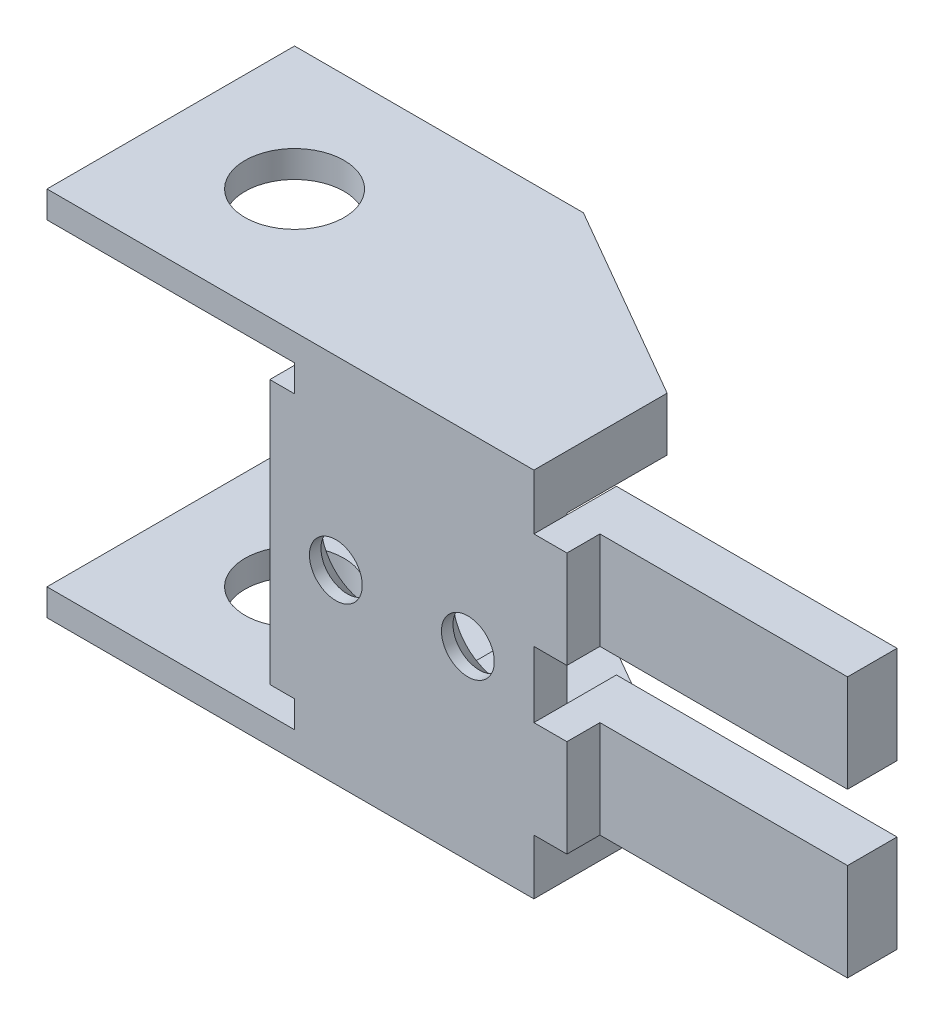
ISO-10303-21;
HEADER;
FILE_DESCRIPTION(('STEP AP214'),'2;1');
FILE_NAME('part.step','',(''),(''),'','','');
FILE_SCHEMA(('AUTOMOTIVE_DESIGN { 1 0 10303 214 1 1 1 1 }'));
ENDSEC;
DATA;
#1=APPLICATION_CONTEXT('core data for automotive mechanical design processes');
#2=APPLICATION_PROTOCOL_DEFINITION('international standard','automotive_design',2000,#1);
#3=PRODUCT_CONTEXT('',#1,'mechanical');
#4=PRODUCT('Part','Part','',(#3));
#5=PRODUCT_RELATED_PRODUCT_CATEGORY('part','',(#4));
#6=PRODUCT_DEFINITION_FORMATION('','',#4);
#7=PRODUCT_DEFINITION_CONTEXT('part definition',#1,'design');
#8=PRODUCT_DEFINITION('design','',#6,#7);
#9=PRODUCT_DEFINITION_SHAPE('','',#8);
#10=(LENGTH_UNIT() NAMED_UNIT(*) SI_UNIT(.MILLI.,.METRE.));
#11=(NAMED_UNIT(*) PLANE_ANGLE_UNIT() SI_UNIT($,.RADIAN.));
#12=(NAMED_UNIT(*) SI_UNIT($,.STERADIAN.) SOLID_ANGLE_UNIT());
#13=UNCERTAINTY_MEASURE_WITH_UNIT(LENGTH_MEASURE(1.E-05),#10,'distance_accuracy_value','');
#14=(GEOMETRIC_REPRESENTATION_CONTEXT(3) GLOBAL_UNCERTAINTY_ASSIGNED_CONTEXT((#13)) GLOBAL_UNIT_ASSIGNED_CONTEXT((#10,
#11,#12)) REPRESENTATION_CONTEXT('',''));
#15=CARTESIAN_POINT('',(0.,0.,0.));
#16=DIRECTION('',(0.,0.,1.));
#17=DIRECTION('',(1.,0.,0.));
#18=AXIS2_PLACEMENT_3D('',#15,#16,#17);
#19=CARTESIAN_POINT('',(-90.,8.00000000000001,41.5000000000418));
#20=DIRECTION('',(0.,0.,-1.));
#21=DIRECTION('',(-1.,0.,0.));
#22=AXIS2_PLACEMENT_3D('',#19,#20,#21);
#23=CONICAL_SURFACE('',#22,2.89999999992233,0.785398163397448);
#24=CARTESIAN_POINT('',(-90.,8.00000000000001,42.8));
#25=DIRECTION('',(0.,0.,-1.));
#26=DIRECTION('',(-1.,0.,0.));
#27=AXIS2_PLACEMENT_3D('',#24,#25,#26);
#28=CIRCLE('',#27,1.6);
#29=CARTESIAN_POINT('',(-91.6,8.00000000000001,42.8));
#30=VERTEX_POINT('',#29);
#31=EDGE_CURVE('E279',#30,#30,#28,.F.);
#32=ORIENTED_EDGE('',*,*,#31,.T.);
#33=EDGE_LOOP('',(#32));
#34=FACE_BOUND('',#33,.T.);
#35=CARTESIAN_POINT('',(-90.,8.00000000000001,41.499999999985));
#36=DIRECTION('',(0.,0.,-1.));
#37=DIRECTION('',(-1.,0.,0.));
#38=AXIS2_PLACEMENT_3D('',#35,#36,#37);
#39=CIRCLE('',#38,2.89999999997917);
#40=CARTESIAN_POINT('',(-92.8999999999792,8.00000000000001,41.499999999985));
#41=VERTEX_POINT('',#40);
#42=EDGE_CURVE('E19',#41,#41,#39,.F.);
#43=ORIENTED_EDGE('',*,*,#42,.F.);
#44=EDGE_LOOP('',(#43));
#45=FACE_BOUND('',#44,.T.);
#46=ADVANCED_FACE('F16',(#34,#45),#23,.F.);
#47=CARTESIAN_POINT('',(-82.,8.00000000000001,41.5000000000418));
#48=DIRECTION('',(0.,0.,-1.));
#49=DIRECTION('',(-1.,0.,0.));
#50=AXIS2_PLACEMENT_3D('',#47,#48,#49);
#51=CONICAL_SURFACE('',#50,2.89999999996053,0.785398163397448);
#52=CARTESIAN_POINT('',(-82.,8.00000000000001,42.8));
#53=DIRECTION('',(0.,0.,-1.));
#54=DIRECTION('',(-1.,0.,0.));
#55=AXIS2_PLACEMENT_3D('',#52,#53,#54);
#56=CIRCLE('',#55,1.6);
#57=CARTESIAN_POINT('',(-83.6,8.00000000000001,42.8));
#58=VERTEX_POINT('',#57);
#59=EDGE_CURVE('E275',#58,#58,#56,.F.);
#60=ORIENTED_EDGE('',*,*,#59,.T.);
#61=EDGE_LOOP('',(#60));
#62=FACE_BOUND('',#61,.T.);
#63=CARTESIAN_POINT('',(-82.,8.00000000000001,41.499999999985));
#64=DIRECTION('',(0.,0.,-1.));
#65=DIRECTION('',(-1.,0.,0.));
#66=AXIS2_PLACEMENT_3D('',#63,#64,#65);
#67=CIRCLE('',#66,2.90000000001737);
#68=CARTESIAN_POINT('',(-84.9000000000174,8.00000000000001,41.499999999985));
#69=VERTEX_POINT('',#68);
#70=EDGE_CURVE('E282',#69,#69,#67,.F.);
#71=ORIENTED_EDGE('',*,*,#70,.F.);
#72=EDGE_LOOP('',(#71));
#73=FACE_BOUND('',#72,.T.);
#74=ADVANCED_FACE('F901',(#62,#73),#51,.F.);
#75=CARTESIAN_POINT('',(-92.5,-0.8125,39.75));
#76=DIRECTION('',(-1.,0.,0.));
#77=DIRECTION('',(0.,0.,1.));
#78=AXIS2_PLACEMENT_3D('',#75,#76,#77);
#79=PLANE('',#78);
#80=DIRECTION('',(0.,1.,0.));
#81=VECTOR('',#80,1.);
#82=CARTESIAN_POINT('',(-92.5,-0.8125,43.5));
#83=LINE('',#82,#81);
#84=CARTESIAN_POINT('',(-92.5,-1.625,43.5));
#85=VERTEX_POINT('',#84);
#86=CARTESIAN_POINT('',(-92.5,0.,43.5));
#87=VERTEX_POINT('',#86);
#88=EDGE_CURVE('E272',#85,#87,#83,.T.);
#89=ORIENTED_EDGE('',*,*,#88,.T.);
#90=DIRECTION('',(0.,0.,1.));
#91=VECTOR('',#90,1.);
#92=CARTESIAN_POINT('',(-92.5,0.,39.75));
#93=LINE('',#92,#91);
#94=CARTESIAN_POINT('',(-92.5,0.,41.5));
#95=VERTEX_POINT('',#94);
#96=EDGE_CURVE('E345',#87,#95,#93,.F.);
#97=ORIENTED_EDGE('',*,*,#96,.T.);
#98=DIRECTION('',(0.,1.,0.));
#99=VECTOR('',#98,1.);
#100=CARTESIAN_POINT('',(-92.5,17.625,41.5));
#101=LINE('',#100,#99);
#102=CARTESIAN_POINT('',(-92.5,-1.625,41.5));
#103=VERTEX_POINT('',#102);
#104=EDGE_CURVE('E312',#103,#95,#101,.T.);
#105=ORIENTED_EDGE('',*,*,#104,.F.);
#106=DIRECTION('',(0.,0.,1.));
#107=VECTOR('',#106,1.);
#108=CARTESIAN_POINT('',(-92.5,-1.625,36.));
#109=LINE('',#108,#107);
#110=EDGE_CURVE('E278',#85,#103,#109,.F.);
#111=ORIENTED_EDGE('',*,*,#110,.F.);
#112=EDGE_LOOP('',(#89,#97,#105,#111));
#113=FACE_BOUND('',#112,.T.);
#114=ADVANCED_FACE('F442',(#113),#79,.T.);
#115=CARTESIAN_POINT('',(-89.,8.,36.));
#116=DIRECTION('',(-1.,0.,0.));
#117=DIRECTION('',(0.,0.,1.));
#118=AXIS2_PLACEMENT_3D('',#115,#116,#117);
#119=PLANE('',#118);
#120=DIRECTION('',(0.,1.,0.));
#121=VECTOR('',#120,1.);
#122=CARTESIAN_POINT('',(-89.,19.25,29.0773502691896));
#123=LINE('',#122,#121);
#124=CARTESIAN_POINT('',(-89.,-1.625,29.0773502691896));
#125=VERTEX_POINT('',#124);
#126=CARTESIAN_POINT('',(-89.,0.,29.0773502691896));
#127=VERTEX_POINT('',#126);
#128=EDGE_CURVE('E238',#125,#127,#123,.T.);
#129=ORIENTED_EDGE('',*,*,#128,.F.);
#130=DIRECTION('',(0.,0.,1.));
#131=VECTOR('',#130,1.);
#132=CARTESIAN_POINT('',(-89.,-1.625,36.));
#133=LINE('',#132,#131);
#134=CARTESIAN_POINT('',(-89.,-1.625,41.5));
#135=VERTEX_POINT('',#134);
#136=EDGE_CURVE('E432',#135,#125,#133,.F.);
#137=ORIENTED_EDGE('',*,*,#136,.F.);
#138=DIRECTION('',(0.,1.,0.));
#139=VECTOR('',#138,1.);
#140=CARTESIAN_POINT('',(-89.,17.625,41.5));
#141=LINE('',#140,#139);
#142=CARTESIAN_POINT('',(-89.,0.,41.5));
#143=VERTEX_POINT('',#142);
#144=EDGE_CURVE('E255',#143,#135,#141,.F.);
#145=ORIENTED_EDGE('',*,*,#144,.F.);
#146=DIRECTION('',(0.,0.,1.));
#147=VECTOR('',#146,1.);
#148=CARTESIAN_POINT('',(-89.,0.,36.));
#149=LINE('',#148,#147);
#150=EDGE_CURVE('E253',#127,#143,#149,.T.);
#151=ORIENTED_EDGE('',*,*,#150,.F.);
#152=EDGE_LOOP('',(#129,#137,#145,#151));
#153=FACE_BOUND('',#152,.T.);
#154=ADVANCED_FACE('F254',(#153),#119,.T.);
#155=CARTESIAN_POINT('',(-100.,8.,36.));
#156=DIRECTION('',(0.,-1.,0.));
#157=DIRECTION('',(0.,0.,-1.));
#158=AXIS2_PLACEMENT_3D('',#155,#156,#157);
#159=CYLINDRICAL_SURFACE('',#158,3.);
#160=CARTESIAN_POINT('',(-100.,-1.625,36.));
#161=DIRECTION('',(0.,-1.,0.));
#162=DIRECTION('',(0.,0.,-1.));
#163=AXIS2_PLACEMENT_3D('',#160,#161,#162);
#164=CIRCLE('',#163,3.);
#165=CARTESIAN_POINT('',(-100.,-1.625,33.));
#166=VERTEX_POINT('',#165);
#167=EDGE_CURVE('E305',#166,#166,#164,.T.);
#168=ORIENTED_EDGE('',*,*,#167,.F.);
#169=EDGE_LOOP('',(#168));
#170=FACE_BOUND('',#169,.T.);
#171=CARTESIAN_POINT('',(-100.,-3.25,36.));
#172=DIRECTION('',(0.,-1.,0.));
#173=DIRECTION('',(0.,0.,-1.));
#174=AXIS2_PLACEMENT_3D('',#171,#172,#173);
#175=CIRCLE('',#174,3.);
#176=CARTESIAN_POINT('',(-100.,-3.25,33.));
#177=VERTEX_POINT('',#176);
#178=EDGE_CURVE('E301',#177,#177,#175,.T.);
#179=ORIENTED_EDGE('',*,*,#178,.T.);
#180=EDGE_LOOP('',(#179));
#181=FACE_BOUND('',#180,.T.);
#182=ADVANCED_FACE('F932',(#170,#181),#159,.F.);
#183=CARTESIAN_POINT('',(-107.5,8.,36.));
#184=DIRECTION('',(1.,0.,0.));
#185=DIRECTION('',(0.,0.,-1.));
#186=AXIS2_PLACEMENT_3D('',#183,#184,#185);
#187=PLANE('',#186);
#188=DIRECTION('',(0.,1.,0.));
#189=VECTOR('',#188,1.);
#190=CARTESIAN_POINT('',(-107.5,19.25,28.5));
#191=LINE('',#190,#189);
#192=CARTESIAN_POINT('',(-107.5,-3.25,28.5));
#193=VERTEX_POINT('',#192);
#194=CARTESIAN_POINT('',(-107.5,-1.625,28.5));
#195=VERTEX_POINT('',#194);
#196=EDGE_CURVE('E268',#193,#195,#191,.T.);
#197=ORIENTED_EDGE('',*,*,#196,.F.);
#198=DIRECTION('',(0.,0.,1.));
#199=VECTOR('',#198,1.);
#200=CARTESIAN_POINT('',(-107.5,-3.25,36.8005982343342));
#201=LINE('',#200,#199);
#202=CARTESIAN_POINT('',(-107.5,-3.25,43.5));
#203=VERTEX_POINT('',#202);
#204=EDGE_CURVE('E304',#193,#203,#201,.T.);
#205=ORIENTED_EDGE('',*,*,#204,.T.);
#206=DIRECTION('',(0.,1.,0.));
#207=VECTOR('',#206,1.);
#208=CARTESIAN_POINT('',(-107.5,8.,43.5));
#209=LINE('',#208,#207);
#210=CARTESIAN_POINT('',(-107.5,-1.625,43.5));
#211=VERTEX_POINT('',#210);
#212=EDGE_CURVE('E270',#211,#203,#209,.F.);
#213=ORIENTED_EDGE('',*,*,#212,.F.);
#214=DIRECTION('',(0.,0.,1.));
#215=VECTOR('',#214,1.);
#216=CARTESIAN_POINT('',(-107.5,-1.625,36.));
#217=LINE('',#216,#215);
#218=EDGE_CURVE('E307',#195,#211,#217,.T.);
#219=ORIENTED_EDGE('',*,*,#218,.F.);
#220=EDGE_LOOP('',(#197,#205,#213,#219));
#221=FACE_BOUND('',#220,.T.);
#222=ADVANCED_FACE('F454',(#221),#187,.F.);
#223=CARTESIAN_POINT('',(-90.,19.25,28.5));
#224=DIRECTION('',(0.,0.,-1.));
#225=DIRECTION('',(-1.,0.,0.));
#226=AXIS2_PLACEMENT_3D('',#223,#224,#225);
#227=PLANE('',#226);
#228=DIRECTION('',(1.,0.,0.));
#229=VECTOR('',#228,1.);
#230=CARTESIAN_POINT('',(-92.3880407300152,-3.25,28.5));
#231=LINE('',#230,#229);
#232=CARTESIAN_POINT('',(-90.,-3.25,28.5));
#233=VERTEX_POINT('',#232);
#234=EDGE_CURVE('E418',#233,#193,#231,.F.);
#235=ORIENTED_EDGE('',*,*,#234,.T.);
#236=ORIENTED_EDGE('',*,*,#196,.T.);
#237=DIRECTION('',(1.,0.,0.));
#238=VECTOR('',#237,1.);
#239=CARTESIAN_POINT('',(-98.25,-1.625,28.5));
#240=LINE('',#239,#238);
#241=CARTESIAN_POINT('',(-90.,-1.625,28.5));
#242=VERTEX_POINT('',#241);
#243=EDGE_CURVE('E428',#242,#195,#240,.F.);
#244=ORIENTED_EDGE('',*,*,#243,.F.);
#245=DIRECTION('',(0.,1.,0.));
#246=VECTOR('',#245,1.);
#247=CARTESIAN_POINT('',(-90.,19.25,28.5));
#248=LINE('',#247,#246);
#249=EDGE_CURVE('E250',#233,#242,#248,.T.);
#250=ORIENTED_EDGE('',*,*,#249,.F.);
#251=EDGE_LOOP('',(#235,#236,#244,#250));
#252=FACE_BOUND('',#251,.T.);
#253=ADVANCED_FACE('F450',(#252),#227,.T.);
#254=CARTESIAN_POINT('',(-78.,19.25,35.4282032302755));
#255=DIRECTION('',(0.5,0.,-0.866025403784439));
#256=DIRECTION('',(-0.866025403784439,0.,-0.5));
#257=AXIS2_PLACEMENT_3D('',#254,#255,#256);
#258=PLANE('',#257);
#259=DIRECTION('',(-0.866025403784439,0.,-0.5));
#260=VECTOR('',#259,1.);
#261=CARTESIAN_POINT('',(-89.,-1.625,29.0773502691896));
#262=LINE('',#261,#260);
#263=EDGE_CURVE('E246',#125,#242,#262,.T.);
#264=ORIENTED_EDGE('',*,*,#263,.F.);
#265=ORIENTED_EDGE('',*,*,#128,.T.);
#266=DIRECTION('',(-0.866025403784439,0.,-0.5));
#267=VECTOR('',#266,1.);
#268=CARTESIAN_POINT('',(-78.,0.,35.4282032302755));
#269=LINE('',#268,#267);
#270=CARTESIAN_POINT('',(-78.,0.,35.4282032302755));
#271=VERTEX_POINT('',#270);
#272=EDGE_CURVE('E243',#271,#127,#269,.T.);
#273=ORIENTED_EDGE('',*,*,#272,.F.);
#274=DIRECTION('',(0.,1.,0.));
#275=VECTOR('',#274,1.);
#276=CARTESIAN_POINT('',(-78.,-1.89999999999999,35.4282032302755));
#277=LINE('',#276,#275);
#278=CARTESIAN_POINT('',(-78.,-3.25,35.4282032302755));
#279=VERTEX_POINT('',#278);
#280=EDGE_CURVE('E410',#279,#271,#277,.T.);
#281=ORIENTED_EDGE('',*,*,#280,.F.);
#282=DIRECTION('',(-0.866025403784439,0.,-0.5));
#283=VECTOR('',#282,1.);
#284=CARTESIAN_POINT('',(-78.,-3.25,35.4282032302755));
#285=LINE('',#284,#283);
#286=EDGE_CURVE('E421',#279,#233,#285,.T.);
#287=ORIENTED_EDGE('',*,*,#286,.T.);
#288=ORIENTED_EDGE('',*,*,#249,.T.);
#289=EDGE_LOOP('',(#264,#265,#273,#281,#287,#288));
#290=FACE_BOUND('',#289,.T.);
#291=ADVANCED_FACE('F240',(#290),#258,.T.);
#292=CARTESIAN_POINT('',(-90.5,0.,36.));
#293=DIRECTION('',(0.,1.,0.));
#294=DIRECTION('',(0.,0.,1.));
#295=AXIS2_PLACEMENT_3D('',#292,#293,#294);
#296=PLANE('',#295);
#297=ORIENTED_EDGE('',*,*,#272,.T.);
#298=ORIENTED_EDGE('',*,*,#150,.T.);
#299=DIRECTION('',(-1.,0.,0.));
#300=VECTOR('',#299,1.);
#301=CARTESIAN_POINT('',(-78.,0.,41.5));
#302=LINE('',#301,#300);
#303=CARTESIAN_POINT('',(-78.,0.,41.5));
#304=VERTEX_POINT('',#303);
#305=EDGE_CURVE('E320',#304,#143,#302,.T.);
#306=ORIENTED_EDGE('',*,*,#305,.F.);
#307=DIRECTION('',(0.,0.,-1.));
#308=VECTOR('',#307,1.);
#309=CARTESIAN_POINT('',(-78.,0.,39.75));
#310=LINE('',#309,#308);
#311=EDGE_CURVE('E262',#271,#304,#310,.F.);
#312=ORIENTED_EDGE('',*,*,#311,.F.);
#313=EDGE_LOOP('',(#297,#298,#306,#312));
#314=FACE_BOUND('',#313,.T.);
#315=ADVANCED_FACE('F260',(#314),#296,.T.);
#316=CARTESIAN_POINT('',(-76.,17.625,41.5));
#317=DIRECTION('',(0.,0.,1.));
#318=DIRECTION('',(1.,0.,0.));
#319=AXIS2_PLACEMENT_3D('',#316,#317,#318);
#320=PLANE('',#319);
#321=DIRECTION('',(1.,0.,0.));
#322=VECTOR('',#321,1.);
#323=CARTESIAN_POINT('',(-69.5,6.00000000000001,41.5));
#324=LINE('',#323,#322);
#325=CARTESIAN_POINT('',(-76.,6.00000000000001,41.5));
#326=VERTEX_POINT('',#325);
#327=CARTESIAN_POINT('',(-61.,6.00000000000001,41.5));
#328=VERTEX_POINT('',#327);
#329=EDGE_CURVE('E555',#326,#328,#324,.T.);
#330=ORIENTED_EDGE('',*,*,#329,.F.);
#331=DIRECTION('',(0.,1.,0.));
#332=VECTOR('',#331,1.);
#333=CARTESIAN_POINT('',(-76.,17.625,41.5));
#334=LINE('',#333,#332);
#335=CARTESIAN_POINT('',(-76.,0.100000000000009,41.5));
#336=VERTEX_POINT('',#335);
#337=EDGE_CURVE('E391',#336,#326,#334,.T.);
#338=ORIENTED_EDGE('',*,*,#337,.F.);
#339=DIRECTION('',(1.,0.,0.));
#340=VECTOR('',#339,1.);
#341=CARTESIAN_POINT('',(-69.5,0.100000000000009,41.5));
#342=LINE('',#341,#340);
#343=CARTESIAN_POINT('',(-61.,0.100000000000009,41.5));
#344=VERTEX_POINT('',#343);
#345=EDGE_CURVE('E389',#344,#336,#342,.F.);
#346=ORIENTED_EDGE('',*,*,#345,.F.);
#347=DIRECTION('',(0.,1.,0.));
#348=VECTOR('',#347,1.);
#349=CARTESIAN_POINT('',(-61.,17.625,41.5));
#350=LINE('',#349,#348);
#351=EDGE_CURVE('E258',#328,#344,#350,.F.);
#352=ORIENTED_EDGE('',*,*,#351,.F.);
#353=EDGE_LOOP('',(#330,#338,#346,#352));
#354=FACE_BOUND('',#353,.T.);
#355=ADVANCED_FACE('F390',(#354),#320,.T.);
#356=CARTESIAN_POINT('',(-61.,17.625,41.5));
#357=DIRECTION('',(1.,0.,0.));
#358=DIRECTION('',(0.,0.,-1.));
#359=AXIS2_PLACEMENT_3D('',#356,#357,#358);
#360=PLANE('',#359);
#361=DIRECTION('',(0.,0.,1.));
#362=VECTOR('',#361,1.);
#363=CARTESIAN_POINT('',(-61.,6.00000000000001,39.75));
#364=LINE('',#363,#362);
#365=CARTESIAN_POINT('',(-61.,6.00000000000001,38.5));
#366=VERTEX_POINT('',#365);
#367=EDGE_CURVE('E384',#328,#366,#364,.F.);
#368=ORIENTED_EDGE('',*,*,#367,.F.);
#369=ORIENTED_EDGE('',*,*,#351,.T.);
#370=DIRECTION('',(0.,0.,-1.));
#371=VECTOR('',#370,1.);
#372=CARTESIAN_POINT('',(-61.,0.100000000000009,39.75));
#373=LINE('',#372,#371);
#374=CARTESIAN_POINT('',(-61.,0.100000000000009,38.5));
#375=VERTEX_POINT('',#374);
#376=EDGE_CURVE('E381',#375,#344,#373,.F.);
#377=ORIENTED_EDGE('',*,*,#376,.F.);
#378=DIRECTION('',(0.,1.,0.));
#379=VECTOR('',#378,1.);
#380=CARTESIAN_POINT('',(-61.,17.625,38.5));
#381=LINE('',#380,#379);
#382=EDGE_CURVE('E374',#366,#375,#381,.F.);
#383=ORIENTED_EDGE('',*,*,#382,.F.);
#384=EDGE_LOOP('',(#368,#369,#377,#383));
#385=FACE_BOUND('',#384,.T.);
#386=ADVANCED_FACE('F379',(#385),#360,.T.);
#387=CARTESIAN_POINT('',(-61.,17.625,38.5));
#388=DIRECTION('',(0.,0.,-1.));
#389=DIRECTION('',(-1.,0.,0.));
#390=AXIS2_PLACEMENT_3D('',#387,#388,#389);
#391=PLANE('',#390);
#392=DIRECTION('',(1.,0.,0.));
#393=VECTOR('',#392,1.);
#394=CARTESIAN_POINT('',(-69.5,6.00000000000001,38.5));
#395=LINE('',#394,#393);
#396=CARTESIAN_POINT('',(-78.,6.00000000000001,38.5));
#397=VERTEX_POINT('',#396);
#398=EDGE_CURVE('E551',#366,#397,#395,.F.);
#399=ORIENTED_EDGE('',*,*,#398,.F.);
#400=ORIENTED_EDGE('',*,*,#382,.T.);
#401=DIRECTION('',(1.,0.,0.));
#402=VECTOR('',#401,1.);
#403=CARTESIAN_POINT('',(-69.5,0.100000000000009,38.5));
#404=LINE('',#403,#402);
#405=CARTESIAN_POINT('',(-78.,0.100000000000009,38.5));
#406=VERTEX_POINT('',#405);
#407=EDGE_CURVE('E399',#406,#375,#404,.T.);
#408=ORIENTED_EDGE('',*,*,#407,.F.);
#409=DIRECTION('',(0.,1.,0.));
#410=VECTOR('',#409,1.);
#411=CARTESIAN_POINT('',(-78.,17.625,38.5));
#412=LINE('',#411,#410);
#413=EDGE_CURVE('E372',#397,#406,#412,.F.);
#414=ORIENTED_EDGE('',*,*,#413,.F.);
#415=EDGE_LOOP('',(#399,#400,#408,#414));
#416=FACE_BOUND('',#415,.T.);
#417=ADVANCED_FACE('F650',(#416),#391,.T.);
#418=CARTESIAN_POINT('',(-78.,17.625,38.5));
#419=DIRECTION('',(-1.,0.,0.));
#420=DIRECTION('',(0.,0.,1.));
#421=AXIS2_PLACEMENT_3D('',#418,#419,#420);
#422=PLANE('',#421);
#423=DIRECTION('',(0.,0.,1.));
#424=VECTOR('',#423,1.);
#425=CARTESIAN_POINT('',(-78.,6.00000000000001,39.75));
#426=LINE('',#425,#424);
#427=CARTESIAN_POINT('',(-78.,6.00000000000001,41.5));
#428=VERTEX_POINT('',#427);
#429=EDGE_CURVE('E548',#397,#428,#426,.T.);
#430=ORIENTED_EDGE('',*,*,#429,.F.);
#431=ORIENTED_EDGE('',*,*,#413,.T.);
#432=DIRECTION('',(0.,0.,-1.));
#433=VECTOR('',#432,1.);
#434=CARTESIAN_POINT('',(-78.,0.100000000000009,39.75));
#435=LINE('',#434,#433);
#436=CARTESIAN_POINT('',(-78.,0.100000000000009,41.5));
#437=VERTEX_POINT('',#436);
#438=EDGE_CURVE('E401',#437,#406,#435,.T.);
#439=ORIENTED_EDGE('',*,*,#438,.F.);
#440=DIRECTION('',(0.,1.,0.));
#441=VECTOR('',#440,1.);
#442=CARTESIAN_POINT('',(-78.,17.625,41.5));
#443=LINE('',#442,#441);
#444=EDGE_CURVE('E326',#428,#437,#443,.F.);
#445=ORIENTED_EDGE('',*,*,#444,.F.);
#446=EDGE_LOOP('',(#430,#431,#439,#445));
#447=FACE_BOUND('',#446,.T.);
#448=ADVANCED_FACE('F647',(#447),#422,.T.);
#449=CARTESIAN_POINT('',(-76.,17.625,41.5));
#450=DIRECTION('',(0.,0.,1.));
#451=DIRECTION('',(1.,0.,0.));
#452=AXIS2_PLACEMENT_3D('',#449,#450,#451);
#453=PLANE('',#452);
#454=DIRECTION('',(1.,0.,0.));
#455=VECTOR('',#454,1.);
#456=CARTESIAN_POINT('',(-69.5,15.9,41.5));
#457=LINE('',#456,#455);
#458=CARTESIAN_POINT('',(-76.,15.9,41.5));
#459=VERTEX_POINT('',#458);
#460=CARTESIAN_POINT('',(-61.,15.9,41.5));
#461=VERTEX_POINT('',#460);
#462=EDGE_CURVE('E519',#459,#461,#457,.T.);
#463=ORIENTED_EDGE('',*,*,#462,.F.);
#464=DIRECTION('',(0.,1.,0.));
#465=VECTOR('',#464,1.);
#466=CARTESIAN_POINT('',(-76.,17.625,41.5));
#467=LINE('',#466,#465);
#468=CARTESIAN_POINT('',(-76.,10.,41.5));
#469=VERTEX_POINT('',#468);
#470=EDGE_CURVE('E522',#469,#459,#467,.T.);
#471=ORIENTED_EDGE('',*,*,#470,.F.);
#472=DIRECTION('',(1.,0.,0.));
#473=VECTOR('',#472,1.);
#474=CARTESIAN_POINT('',(-69.5,10.,41.5));
#475=LINE('',#474,#473);
#476=CARTESIAN_POINT('',(-61.,10.,41.5));
#477=VERTEX_POINT('',#476);
#478=EDGE_CURVE('E528',#477,#469,#475,.F.);
#479=ORIENTED_EDGE('',*,*,#478,.F.);
#480=DIRECTION('',(0.,1.,0.));
#481=VECTOR('',#480,1.);
#482=CARTESIAN_POINT('',(-61.,17.625,41.5));
#483=LINE('',#482,#481);
#484=EDGE_CURVE('E370',#461,#477,#483,.F.);
#485=ORIENTED_EDGE('',*,*,#484,.F.);
#486=EDGE_LOOP('',(#463,#471,#479,#485));
#487=FACE_BOUND('',#486,.T.);
#488=ADVANCED_FACE('F657',(#487),#453,.T.);
#489=CARTESIAN_POINT('',(-61.,17.625,41.5));
#490=DIRECTION('',(1.,0.,0.));
#491=DIRECTION('',(0.,0.,-1.));
#492=AXIS2_PLACEMENT_3D('',#489,#490,#491);
#493=PLANE('',#492);
#494=DIRECTION('',(0.,0.,1.));
#495=VECTOR('',#494,1.);
#496=CARTESIAN_POINT('',(-61.,15.9,39.75));
#497=LINE('',#496,#495);
#498=CARTESIAN_POINT('',(-61.,15.9,38.5));
#499=VERTEX_POINT('',#498);
#500=EDGE_CURVE('E516',#461,#499,#497,.F.);
#501=ORIENTED_EDGE('',*,*,#500,.F.);
#502=ORIENTED_EDGE('',*,*,#484,.T.);
#503=DIRECTION('',(0.,0.,-1.));
#504=VECTOR('',#503,1.);
#505=CARTESIAN_POINT('',(-61.,10.,39.75));
#506=LINE('',#505,#504);
#507=CARTESIAN_POINT('',(-61.,10.,38.5));
#508=VERTEX_POINT('',#507);
#509=EDGE_CURVE('E530',#508,#477,#506,.F.);
#510=ORIENTED_EDGE('',*,*,#509,.F.);
#511=DIRECTION('',(0.,1.,0.));
#512=VECTOR('',#511,1.);
#513=CARTESIAN_POINT('',(-61.,17.625,38.5));
#514=LINE('',#513,#512);
#515=EDGE_CURVE('E368',#499,#508,#514,.F.);
#516=ORIENTED_EDGE('',*,*,#515,.F.);
#517=EDGE_LOOP('',(#501,#502,#510,#516));
#518=FACE_BOUND('',#517,.T.);
#519=ADVANCED_FACE('F661',(#518),#493,.T.);
#520=CARTESIAN_POINT('',(-61.,17.625,38.5));
#521=DIRECTION('',(0.,0.,-1.));
#522=DIRECTION('',(-1.,0.,0.));
#523=AXIS2_PLACEMENT_3D('',#520,#521,#522);
#524=PLANE('',#523);
#525=DIRECTION('',(1.,0.,0.));
#526=VECTOR('',#525,1.);
#527=CARTESIAN_POINT('',(-69.5,15.9,38.5));
#528=LINE('',#527,#526);
#529=CARTESIAN_POINT('',(-78.,15.9,38.5));
#530=VERTEX_POINT('',#529);
#531=EDGE_CURVE('E513',#499,#530,#528,.F.);
#532=ORIENTED_EDGE('',*,*,#531,.F.);
#533=ORIENTED_EDGE('',*,*,#515,.T.);
#534=DIRECTION('',(1.,0.,0.));
#535=VECTOR('',#534,1.);
#536=CARTESIAN_POINT('',(-69.5,10.,38.5));
#537=LINE('',#536,#535);
#538=CARTESIAN_POINT('',(-78.,10.,38.5));
#539=VERTEX_POINT('',#538);
#540=EDGE_CURVE('E533',#539,#508,#537,.T.);
#541=ORIENTED_EDGE('',*,*,#540,.F.);
#542=DIRECTION('',(0.,1.,0.));
#543=VECTOR('',#542,1.);
#544=CARTESIAN_POINT('',(-78.,17.625,38.5));
#545=LINE('',#544,#543);
#546=EDGE_CURVE('E366',#530,#539,#545,.F.);
#547=ORIENTED_EDGE('',*,*,#546,.F.);
#548=EDGE_LOOP('',(#532,#533,#541,#547));
#549=FACE_BOUND('',#548,.T.);
#550=ADVANCED_FACE('F663',(#549),#524,.T.);
#551=CARTESIAN_POINT('',(-78.,17.625,38.5));
#552=DIRECTION('',(-1.,0.,0.));
#553=DIRECTION('',(0.,0.,1.));
#554=AXIS2_PLACEMENT_3D('',#551,#552,#553);
#555=PLANE('',#554);
#556=DIRECTION('',(0.,0.,1.));
#557=VECTOR('',#556,1.);
#558=CARTESIAN_POINT('',(-78.,15.9,39.75));
#559=LINE('',#558,#557);
#560=CARTESIAN_POINT('',(-78.,15.9,41.5));
#561=VERTEX_POINT('',#560);
#562=EDGE_CURVE('E510',#530,#561,#559,.T.);
#563=ORIENTED_EDGE('',*,*,#562,.F.);
#564=ORIENTED_EDGE('',*,*,#546,.T.);
#565=DIRECTION('',(0.,0.,-1.));
#566=VECTOR('',#565,1.);
#567=CARTESIAN_POINT('',(-78.,10.,39.75));
#568=LINE('',#567,#566);
#569=CARTESIAN_POINT('',(-78.,10.,41.5));
#570=VERTEX_POINT('',#569);
#571=EDGE_CURVE('E536',#570,#539,#568,.T.);
#572=ORIENTED_EDGE('',*,*,#571,.F.);
#573=DIRECTION('',(0.,1.,0.));
#574=VECTOR('',#573,1.);
#575=CARTESIAN_POINT('',(-78.,17.625,41.5));
#576=LINE('',#575,#574);
#577=EDGE_CURVE('E328',#561,#570,#576,.F.);
#578=ORIENTED_EDGE('',*,*,#577,.F.);
#579=EDGE_LOOP('',(#563,#564,#572,#578));
#580=FACE_BOUND('',#579,.T.);
#581=ADVANCED_FACE('F632',(#580),#555,.T.);
#582=CARTESIAN_POINT('',(-90.5,16.,36.));
#583=DIRECTION('',(0.,1.,0.));
#584=DIRECTION('',(0.,0.,1.));
#585=AXIS2_PLACEMENT_3D('',#582,#583,#584);
#586=PLANE('',#585);
#587=DIRECTION('',(0.,0.,1.));
#588=VECTOR('',#587,1.);
#589=CARTESIAN_POINT('',(-89.,16.,36.));
#590=LINE('',#589,#588);
#591=CARTESIAN_POINT('',(-89.,16.,29.0773502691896));
#592=VERTEX_POINT('',#591);
#593=CARTESIAN_POINT('',(-89.,16.,41.5));
#594=VERTEX_POINT('',#593);
#595=EDGE_CURVE('E358',#592,#594,#590,.T.);
#596=ORIENTED_EDGE('',*,*,#595,.F.);
#597=DIRECTION('',(-0.866025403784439,0.,-0.5));
#598=VECTOR('',#597,1.);
#599=CARTESIAN_POINT('',(-78.,16.,35.4282032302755));
#600=LINE('',#599,#598);
#601=CARTESIAN_POINT('',(-78.,16.,35.4282032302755));
#602=VERTEX_POINT('',#601);
#603=EDGE_CURVE('E233',#602,#592,#600,.T.);
#604=ORIENTED_EDGE('',*,*,#603,.F.);
#605=DIRECTION('',(0.,0.,-1.));
#606=VECTOR('',#605,1.);
#607=CARTESIAN_POINT('',(-78.,16.,39.75));
#608=LINE('',#607,#606);
#609=CARTESIAN_POINT('',(-78.,16.,41.5));
#610=VERTEX_POINT('',#609);
#611=EDGE_CURVE('E498',#610,#602,#608,.T.);
#612=ORIENTED_EDGE('',*,*,#611,.F.);
#613=DIRECTION('',(-1.,0.,0.));
#614=VECTOR('',#613,1.);
#615=CARTESIAN_POINT('',(-78.,16.,41.5));
#616=LINE('',#615,#614);
#617=EDGE_CURVE('E330',#594,#610,#616,.F.);
#618=ORIENTED_EDGE('',*,*,#617,.F.);
#619=EDGE_LOOP('',(#596,#604,#612,#618));
#620=FACE_BOUND('',#619,.T.);
#621=ADVANCED_FACE('F620',(#620),#586,.F.);
#622=CARTESIAN_POINT('',(-78.,19.25,35.4282032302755));
#623=DIRECTION('',(0.5,0.,-0.866025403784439));
#624=DIRECTION('',(-0.866025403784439,0.,-0.5));
#625=AXIS2_PLACEMENT_3D('',#622,#623,#624);
#626=PLANE('',#625);
#627=DIRECTION('',(-0.866025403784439,0.,-0.5));
#628=VECTOR('',#627,1.);
#629=CARTESIAN_POINT('',(-78.,19.25,35.4282032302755));
#630=LINE('',#629,#628);
#631=CARTESIAN_POINT('',(-78.,19.25,35.4282032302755));
#632=VERTEX_POINT('',#631);
#633=CARTESIAN_POINT('',(-90.,19.25,28.5));
#634=VERTEX_POINT('',#633);
#635=EDGE_CURVE('E492',#632,#634,#630,.T.);
#636=ORIENTED_EDGE('',*,*,#635,.F.);
#637=DIRECTION('',(0.,1.,0.));
#638=VECTOR('',#637,1.);
#639=CARTESIAN_POINT('',(-78.,17.9,35.4282032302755));
#640=LINE('',#639,#638);
#641=EDGE_CURVE('E300',#602,#632,#640,.T.);
#642=ORIENTED_EDGE('',*,*,#641,.F.);
#643=ORIENTED_EDGE('',*,*,#603,.T.);
#644=DIRECTION('',(0.,1.,0.));
#645=VECTOR('',#644,1.);
#646=CARTESIAN_POINT('',(-89.,8.,29.0773502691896));
#647=LINE('',#646,#645);
#648=CARTESIAN_POINT('',(-89.,17.625,29.0773502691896));
#649=VERTEX_POINT('',#648);
#650=EDGE_CURVE('E360',#649,#592,#647,.F.);
#651=ORIENTED_EDGE('',*,*,#650,.F.);
#652=DIRECTION('',(-0.866025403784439,0.,-0.5));
#653=VECTOR('',#652,1.);
#654=CARTESIAN_POINT('',(-78.,17.625,35.4282032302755));
#655=LINE('',#654,#653);
#656=CARTESIAN_POINT('',(-90.,17.625,28.5));
#657=VERTEX_POINT('',#656);
#658=EDGE_CURVE('E363',#649,#657,#655,.T.);
#659=ORIENTED_EDGE('',*,*,#658,.T.);
#660=DIRECTION('',(0.,1.,0.));
#661=VECTOR('',#660,1.);
#662=CARTESIAN_POINT('',(-90.,19.25,28.5));
#663=LINE('',#662,#661);
#664=EDGE_CURVE('E355',#634,#657,#663,.F.);
#665=ORIENTED_EDGE('',*,*,#664,.F.);
#666=EDGE_LOOP('',(#636,#642,#643,#651,#659,#665));
#667=FACE_BOUND('',#666,.T.);
#668=ADVANCED_FACE('F743',(#667),#626,.T.);
#669=CARTESIAN_POINT('',(-89.,8.,36.));
#670=DIRECTION('',(-1.,0.,0.));
#671=DIRECTION('',(0.,0.,1.));
#672=AXIS2_PLACEMENT_3D('',#669,#670,#671);
#673=PLANE('',#672);
#674=ORIENTED_EDGE('',*,*,#650,.T.);
#675=ORIENTED_EDGE('',*,*,#595,.T.);
#676=DIRECTION('',(0.,1.,0.));
#677=VECTOR('',#676,1.);
#678=CARTESIAN_POINT('',(-89.,17.625,41.5));
#679=LINE('',#678,#677);
#680=CARTESIAN_POINT('',(-89.,17.625,41.5));
#681=VERTEX_POINT('',#680);
#682=EDGE_CURVE('E332',#681,#594,#679,.F.);
#683=ORIENTED_EDGE('',*,*,#682,.F.);
#684=DIRECTION('',(0.,0.,1.));
#685=VECTOR('',#684,1.);
#686=CARTESIAN_POINT('',(-89.,17.625,36.));
#687=LINE('',#686,#685);
#688=EDGE_CURVE('E480',#681,#649,#687,.F.);
#689=ORIENTED_EDGE('',*,*,#688,.T.);
#690=EDGE_LOOP('',(#674,#675,#683,#689));
#691=FACE_BOUND('',#690,.T.);
#692=ADVANCED_FACE('F616',(#691),#673,.T.);
#693=CARTESIAN_POINT('',(-90.,19.25,28.5));
#694=DIRECTION('',(0.,0.,-1.));
#695=DIRECTION('',(-1.,0.,0.));
#696=AXIS2_PLACEMENT_3D('',#693,#694,#695);
#697=PLANE('',#696);
#698=DIRECTION('',(1.,0.,0.));
#699=VECTOR('',#698,1.);
#700=CARTESIAN_POINT('',(-92.3880407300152,19.25,28.5));
#701=LINE('',#700,#699);
#702=CARTESIAN_POINT('',(-107.5,19.25,28.5));
#703=VERTEX_POINT('',#702);
#704=EDGE_CURVE('E489',#634,#703,#701,.F.);
#705=ORIENTED_EDGE('',*,*,#704,.F.);
#706=ORIENTED_EDGE('',*,*,#664,.T.);
#707=DIRECTION('',(1.,0.,0.));
#708=VECTOR('',#707,1.);
#709=CARTESIAN_POINT('',(-98.25,17.625,28.5));
#710=LINE('',#709,#708);
#711=CARTESIAN_POINT('',(-107.5,17.625,28.5));
#712=VERTEX_POINT('',#711);
#713=EDGE_CURVE('E478',#657,#712,#710,.F.);
#714=ORIENTED_EDGE('',*,*,#713,.T.);
#715=DIRECTION('',(0.,1.,0.));
#716=VECTOR('',#715,1.);
#717=CARTESIAN_POINT('',(-107.5,8.,28.5));
#718=LINE('',#717,#716);
#719=EDGE_CURVE('E353',#712,#703,#718,.T.);
#720=ORIENTED_EDGE('',*,*,#719,.T.);
#721=EDGE_LOOP('',(#705,#706,#714,#720));
#722=FACE_BOUND('',#721,.T.);
#723=ADVANCED_FACE('F736',(#722),#697,.T.);
#724=CARTESIAN_POINT('',(-107.5,8.,36.));
#725=DIRECTION('',(1.,0.,0.));
#726=DIRECTION('',(0.,0.,-1.));
#727=AXIS2_PLACEMENT_3D('',#724,#725,#726);
#728=PLANE('',#727);
#729=DIRECTION('',(0.,1.,0.));
#730=VECTOR('',#729,1.);
#731=CARTESIAN_POINT('',(-107.5,8.,43.5));
#732=LINE('',#731,#730);
#733=CARTESIAN_POINT('',(-107.5,19.25,43.5));
#734=VERTEX_POINT('',#733);
#735=CARTESIAN_POINT('',(-107.5,17.625,43.5));
#736=VERTEX_POINT('',#735);
#737=EDGE_CURVE('E351',#734,#736,#732,.F.);
#738=ORIENTED_EDGE('',*,*,#737,.F.);
#739=DIRECTION('',(0.,0.,1.));
#740=VECTOR('',#739,1.);
#741=CARTESIAN_POINT('',(-107.5,19.25,36.8005982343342));
#742=LINE('',#741,#740);
#743=EDGE_CURVE('E486',#703,#734,#742,.T.);
#744=ORIENTED_EDGE('',*,*,#743,.F.);
#745=ORIENTED_EDGE('',*,*,#719,.F.);
#746=DIRECTION('',(0.,0.,1.));
#747=VECTOR('',#746,1.);
#748=CARTESIAN_POINT('',(-107.5,17.625,36.));
#749=LINE('',#748,#747);
#750=EDGE_CURVE('E475',#712,#736,#749,.T.);
#751=ORIENTED_EDGE('',*,*,#750,.T.);
#752=EDGE_LOOP('',(#738,#744,#745,#751));
#753=FACE_BOUND('',#752,.T.);
#754=ADVANCED_FACE('F733',(#753),#728,.F.);
#755=CARTESIAN_POINT('',(-92.5,16.8125,39.75));
#756=DIRECTION('',(-1.,0.,0.));
#757=DIRECTION('',(0.,0.,1.));
#758=AXIS2_PLACEMENT_3D('',#755,#756,#757);
#759=PLANE('',#758);
#760=DIRECTION('',(0.,1.,0.));
#761=VECTOR('',#760,1.);
#762=CARTESIAN_POINT('',(-92.5,16.8125,43.5));
#763=LINE('',#762,#761);
#764=CARTESIAN_POINT('',(-92.5,16.,43.5));
#765=VERTEX_POINT('',#764);
#766=CARTESIAN_POINT('',(-92.5,17.625,43.5));
#767=VERTEX_POINT('',#766);
#768=EDGE_CURVE('E349',#765,#767,#763,.T.);
#769=ORIENTED_EDGE('',*,*,#768,.T.);
#770=DIRECTION('',(0.,0.,1.));
#771=VECTOR('',#770,1.);
#772=CARTESIAN_POINT('',(-92.5,17.625,36.));
#773=LINE('',#772,#771);
#774=CARTESIAN_POINT('',(-92.5,17.625,41.5));
#775=VERTEX_POINT('',#774);
#776=EDGE_CURVE('E295',#767,#775,#773,.F.);
#777=ORIENTED_EDGE('',*,*,#776,.T.);
#778=DIRECTION('',(0.,1.,0.));
#779=VECTOR('',#778,1.);
#780=CARTESIAN_POINT('',(-92.5,17.625,41.5));
#781=LINE('',#780,#779);
#782=CARTESIAN_POINT('',(-92.5,16.,41.5));
#783=VERTEX_POINT('',#782);
#784=EDGE_CURVE('E335',#783,#775,#781,.T.);
#785=ORIENTED_EDGE('',*,*,#784,.F.);
#786=DIRECTION('',(0.,0.,1.));
#787=VECTOR('',#786,1.);
#788=CARTESIAN_POINT('',(-92.5,16.,39.75));
#789=LINE('',#788,#787);
#790=EDGE_CURVE('E342',#765,#783,#789,.F.);
#791=ORIENTED_EDGE('',*,*,#790,.F.);
#792=EDGE_LOOP('',(#769,#777,#785,#791));
#793=FACE_BOUND('',#792,.T.);
#794=ADVANCED_FACE('F606',(#793),#759,.T.);
#795=CARTESIAN_POINT('',(-100.,8.,36.));
#796=DIRECTION('',(0.,-1.,0.));
#797=DIRECTION('',(0.,0.,-1.));
#798=AXIS2_PLACEMENT_3D('',#795,#796,#797);
#799=CYLINDRICAL_SURFACE('',#798,3.);
#800=CARTESIAN_POINT('',(-100.,17.625,36.));
#801=DIRECTION('',(0.,-1.,0.));
#802=DIRECTION('',(0.,0.,-1.));
#803=AXIS2_PLACEMENT_3D('',#800,#801,#802);
#804=CIRCLE('',#803,3.);
#805=CARTESIAN_POINT('',(-100.,17.625,33.));
#806=VERTEX_POINT('',#805);
#807=EDGE_CURVE('E291',#806,#806,#804,.T.);
#808=ORIENTED_EDGE('',*,*,#807,.T.);
#809=EDGE_LOOP('',(#808));
#810=FACE_BOUND('',#809,.T.);
#811=CARTESIAN_POINT('',(-100.,19.25,36.));
#812=DIRECTION('',(0.,-1.,0.));
#813=DIRECTION('',(0.,0.,-1.));
#814=AXIS2_PLACEMENT_3D('',#811,#812,#813);
#815=CIRCLE('',#814,3.);
#816=CARTESIAN_POINT('',(-100.,19.25,33.));
#817=VERTEX_POINT('',#816);
#818=EDGE_CURVE('E296',#817,#817,#815,.T.);
#819=ORIENTED_EDGE('',*,*,#818,.F.);
#820=EDGE_LOOP('',(#819));
#821=FACE_BOUND('',#820,.T.);
#822=ADVANCED_FACE('F727',(#810,#821),#799,.F.);
#823=CARTESIAN_POINT('',(-96.25,0.,39.75));
#824=DIRECTION('',(0.,1.,0.));
#825=DIRECTION('',(0.,0.,1.));
#826=AXIS2_PLACEMENT_3D('',#823,#824,#825);
#827=PLANE('',#826);
#828=ORIENTED_EDGE('',*,*,#96,.F.);
#829=DIRECTION('',(1.,0.,0.));
#830=VECTOR('',#829,1.);
#831=CARTESIAN_POINT('',(-96.25,0.,43.5));
#832=LINE('',#831,#830);
#833=CARTESIAN_POINT('',(-94.,0.,43.5));
#834=VERTEX_POINT('',#833);
#835=EDGE_CURVE('E347',#834,#87,#832,.T.);
#836=ORIENTED_EDGE('',*,*,#835,.F.);
#837=DIRECTION('',(0.,0.,1.));
#838=VECTOR('',#837,1.);
#839=CARTESIAN_POINT('',(-94.,0.,41.5));
#840=LINE('',#839,#838);
#841=CARTESIAN_POINT('',(-94.,0.,41.5));
#842=VERTEX_POINT('',#841);
#843=EDGE_CURVE('E294',#842,#834,#840,.T.);
#844=ORIENTED_EDGE('',*,*,#843,.F.);
#845=DIRECTION('',(-1.,0.,0.));
#846=VECTOR('',#845,1.);
#847=CARTESIAN_POINT('',(-78.,0.,41.5));
#848=LINE('',#847,#846);
#849=EDGE_CURVE('E340',#95,#842,#848,.T.);
#850=ORIENTED_EDGE('',*,*,#849,.F.);
#851=EDGE_LOOP('',(#828,#836,#844,#850));
#852=FACE_BOUND('',#851,.T.);
#853=ADVANCED_FACE('F614',(#852),#827,.F.);
#854=CARTESIAN_POINT('',(-96.25,16.,39.75));
#855=DIRECTION('',(0.,1.,0.));
#856=DIRECTION('',(0.,0.,1.));
#857=AXIS2_PLACEMENT_3D('',#854,#855,#856);
#858=PLANE('',#857);
#859=ORIENTED_EDGE('',*,*,#790,.T.);
#860=DIRECTION('',(-1.,0.,0.));
#861=VECTOR('',#860,1.);
#862=CARTESIAN_POINT('',(-78.,16.,41.5));
#863=LINE('',#862,#861);
#864=CARTESIAN_POINT('',(-94.,16.,41.5));
#865=VERTEX_POINT('',#864);
#866=EDGE_CURVE('E337',#865,#783,#863,.F.);
#867=ORIENTED_EDGE('',*,*,#866,.F.);
#868=DIRECTION('',(0.,0.,1.));
#869=VECTOR('',#868,1.);
#870=CARTESIAN_POINT('',(-94.,16.,41.5));
#871=LINE('',#870,#869);
#872=CARTESIAN_POINT('',(-94.,16.,43.5));
#873=VERTEX_POINT('',#872);
#874=EDGE_CURVE('E468',#873,#865,#871,.F.);
#875=ORIENTED_EDGE('',*,*,#874,.F.);
#876=DIRECTION('',(1.,0.,0.));
#877=VECTOR('',#876,1.);
#878=CARTESIAN_POINT('',(-96.25,16.,43.5));
#879=LINE('',#878,#877);
#880=EDGE_CURVE('E33',#873,#765,#879,.T.);
#881=ORIENTED_EDGE('',*,*,#880,.T.);
#882=EDGE_LOOP('',(#859,#867,#875,#881));
#883=FACE_BOUND('',#882,.T.);
#884=ADVANCED_FACE('F608',(#883),#858,.T.);
#885=CARTESIAN_POINT('',(-78.,17.625,41.5));
#886=DIRECTION('',(0.,0.,-1.));
#887=DIRECTION('',(-1.,0.,0.));
#888=AXIS2_PLACEMENT_3D('',#885,#886,#887);
#889=PLANE('',#888);
#890=ORIENTED_EDGE('',*,*,#70,.T.);
#891=EDGE_LOOP('',(#890));
#892=FACE_BOUND('',#891,.T.);
#893=ORIENTED_EDGE('',*,*,#42,.T.);
#894=EDGE_LOOP('',(#893));
#895=FACE_BOUND('',#894,.T.);
#896=DIRECTION('',(1.,0.,0.));
#897=VECTOR('',#896,1.);
#898=CARTESIAN_POINT('',(-98.25,-1.625,41.5));
#899=LINE('',#898,#897);
#900=EDGE_CURVE('E433',#103,#135,#899,.T.);
#901=ORIENTED_EDGE('',*,*,#900,.F.);
#902=ORIENTED_EDGE('',*,*,#104,.T.);
#903=ORIENTED_EDGE('',*,*,#849,.T.);
#904=DIRECTION('',(0.,1.,0.));
#905=VECTOR('',#904,1.);
#906=CARTESIAN_POINT('',(-94.,17.625,41.5));
#907=LINE('',#906,#905);
#908=EDGE_CURVE('E290',#865,#842,#907,.F.);
#909=ORIENTED_EDGE('',*,*,#908,.F.);
#910=ORIENTED_EDGE('',*,*,#866,.T.);
#911=ORIENTED_EDGE('',*,*,#784,.T.);
#912=DIRECTION('',(1.,0.,0.));
#913=VECTOR('',#912,1.);
#914=CARTESIAN_POINT('',(-98.25,17.625,41.5));
#915=LINE('',#914,#913);
#916=EDGE_CURVE('E483',#775,#681,#915,.T.);
#917=ORIENTED_EDGE('',*,*,#916,.T.);
#918=ORIENTED_EDGE('',*,*,#682,.T.);
#919=ORIENTED_EDGE('',*,*,#617,.T.);
#920=DIRECTION('',(0.,1.,0.));
#921=VECTOR('',#920,1.);
#922=CARTESIAN_POINT('',(-78.,17.9,41.5));
#923=LINE('',#922,#921);
#924=EDGE_CURVE('E501',#561,#610,#923,.T.);
#925=ORIENTED_EDGE('',*,*,#924,.F.);
#926=ORIENTED_EDGE('',*,*,#577,.T.);
#927=DIRECTION('',(0.,1.,0.));
#928=VECTOR('',#927,1.);
#929=CARTESIAN_POINT('',(-78.,8.00000000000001,41.5));
#930=LINE('',#929,#928);
#931=EDGE_CURVE('E545',#428,#570,#930,.T.);
#932=ORIENTED_EDGE('',*,*,#931,.F.);
#933=ORIENTED_EDGE('',*,*,#444,.T.);
#934=DIRECTION('',(0.,1.,0.));
#935=VECTOR('',#934,1.);
#936=CARTESIAN_POINT('',(-78.,-1.89999999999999,41.5));
#937=LINE('',#936,#935);
#938=EDGE_CURVE('E415',#304,#437,#937,.T.);
#939=ORIENTED_EDGE('',*,*,#938,.F.);
#940=ORIENTED_EDGE('',*,*,#305,.T.);
#941=ORIENTED_EDGE('',*,*,#144,.T.);
#942=EDGE_LOOP('',(#901,#902,#903,#909,#910,#911,#917,#918,#919,#925,#926,#932,#933,#939,#940,#941));
#943=FACE_BOUND('',#942,.T.);
#944=ADVANCED_FACE('F445',(#892,#895,#943),#889,.T.);
#945=CARTESIAN_POINT('',(-90.,8.00000000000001,43.15));
#946=DIRECTION('',(0.,0.,-1.));
#947=DIRECTION('',(-1.,0.,0.));
#948=AXIS2_PLACEMENT_3D('',#945,#946,#947);
#949=CYLINDRICAL_SURFACE('',#948,1.6);
#950=CARTESIAN_POINT('',(-90.,8.00000000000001,43.5));
#951=DIRECTION('',(0.,0.,-1.));
#952=DIRECTION('',(-1.,0.,0.));
#953=AXIS2_PLACEMENT_3D('',#950,#951,#952);
#954=CIRCLE('',#953,1.6);
#955=CARTESIAN_POINT('',(-91.6,8.00000000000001,43.5));
#956=VERTEX_POINT('',#955);
#957=EDGE_CURVE('E287',#956,#956,#954,.T.);
#958=ORIENTED_EDGE('',*,*,#957,.F.);
#959=EDGE_LOOP('',(#958));
#960=FACE_BOUND('',#959,.T.);
#961=ORIENTED_EDGE('',*,*,#31,.F.);
#962=EDGE_LOOP('',(#961));
#963=FACE_BOUND('',#962,.T.);
#964=ADVANCED_FACE('F716',(#960,#963),#949,.F.);
#965=CARTESIAN_POINT('',(-82.,8.00000000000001,43.15));
#966=DIRECTION('',(0.,0.,-1.));
#967=DIRECTION('',(-1.,0.,0.));
#968=AXIS2_PLACEMENT_3D('',#965,#966,#967);
#969=CYLINDRICAL_SURFACE('',#968,1.6);
#970=CARTESIAN_POINT('',(-82.,8.00000000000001,43.5));
#971=DIRECTION('',(0.,0.,-1.));
#972=DIRECTION('',(-1.,0.,0.));
#973=AXIS2_PLACEMENT_3D('',#970,#971,#972);
#974=CIRCLE('',#973,1.6);
#975=CARTESIAN_POINT('',(-83.6,8.00000000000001,43.5));
#976=VERTEX_POINT('',#975);
#977=EDGE_CURVE('E283',#976,#976,#974,.T.);
#978=ORIENTED_EDGE('',*,*,#977,.F.);
#979=EDGE_LOOP('',(#978));
#980=FACE_BOUND('',#979,.T.);
#981=ORIENTED_EDGE('',*,*,#59,.F.);
#982=EDGE_LOOP('',(#981));
#983=FACE_BOUND('',#982,.T.);
#984=ADVANCED_FACE('F712',(#980,#983),#969,.F.);
#985=CARTESIAN_POINT('',(-98.25,-1.625,36.));
#986=DIRECTION('',(0.,1.,0.));
#987=DIRECTION('',(0.,0.,1.));
#988=AXIS2_PLACEMENT_3D('',#985,#986,#987);
#989=PLANE('',#988);
#990=ORIENTED_EDGE('',*,*,#167,.T.);
#991=EDGE_LOOP('',(#990));
#992=FACE_BOUND('',#991,.T.);
#993=ORIENTED_EDGE('',*,*,#218,.T.);
#994=DIRECTION('',(1.,0.,0.));
#995=VECTOR('',#994,1.);
#996=CARTESIAN_POINT('',(-78.,-1.625,43.5));
#997=LINE('',#996,#995);
#998=EDGE_CURVE('E286',#85,#211,#997,.F.);
#999=ORIENTED_EDGE('',*,*,#998,.F.);
#1000=ORIENTED_EDGE('',*,*,#110,.T.);
#1001=ORIENTED_EDGE('',*,*,#900,.T.);
#1002=ORIENTED_EDGE('',*,*,#136,.T.);
#1003=ORIENTED_EDGE('',*,*,#263,.T.);
#1004=ORIENTED_EDGE('',*,*,#243,.T.);
#1005=EDGE_LOOP('',(#993,#999,#1000,#1001,#1002,#1003,#1004));
#1006=FACE_BOUND('',#1005,.T.);
#1007=ADVANCED_FACE('F439',(#992,#1006),#989,.T.);
#1008=CARTESIAN_POINT('',(-92.3880407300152,-3.25,36.8005982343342));
#1009=DIRECTION('',(0.,1.,0.));
#1010=DIRECTION('',(0.,0.,1.));
#1011=AXIS2_PLACEMENT_3D('',#1008,#1009,#1010);
#1012=PLANE('',#1011);
#1013=ORIENTED_EDGE('',*,*,#286,.F.);
#1014=DIRECTION('',(0.,0.,-1.));
#1015=VECTOR('',#1014,1.);
#1016=CARTESIAN_POINT('',(-78.,-3.25,39.75));
#1017=LINE('',#1016,#1015);
#1018=CARTESIAN_POINT('',(-78.,-3.25,43.5));
#1019=VERTEX_POINT('',#1018);
#1020=EDGE_CURVE('E412',#1019,#279,#1017,.T.);
#1021=ORIENTED_EDGE('',*,*,#1020,.F.);
#1022=DIRECTION('',(1.,0.,0.));
#1023=VECTOR('',#1022,1.);
#1024=CARTESIAN_POINT('',(-78.,-3.25,43.5));
#1025=LINE('',#1024,#1023);
#1026=EDGE_CURVE('E460',#203,#1019,#1025,.T.);
#1027=ORIENTED_EDGE('',*,*,#1026,.F.);
#1028=ORIENTED_EDGE('',*,*,#204,.F.);
#1029=ORIENTED_EDGE('',*,*,#234,.F.);
#1030=EDGE_LOOP('',(#1013,#1021,#1027,#1028,#1029));
#1031=FACE_BOUND('',#1030,.T.);
#1032=ORIENTED_EDGE('',*,*,#178,.F.);
#1033=EDGE_LOOP('',(#1032));
#1034=FACE_BOUND('',#1033,.T.);
#1035=ADVANCED_FACE('F706',(#1031,#1034),#1012,.F.);
#1036=CARTESIAN_POINT('',(-78.,-1.89999999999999,39.75));
#1037=DIRECTION('',(1.,0.,0.));
#1038=DIRECTION('',(0.,0.,-1.));
#1039=AXIS2_PLACEMENT_3D('',#1036,#1037,#1038);
#1040=PLANE('',#1039);
#1041=ORIENTED_EDGE('',*,*,#280,.T.);
#1042=ORIENTED_EDGE('',*,*,#311,.T.);
#1043=ORIENTED_EDGE('',*,*,#938,.T.);
#1044=DIRECTION('',(0.,0.,-1.));
#1045=VECTOR('',#1044,1.);
#1046=CARTESIAN_POINT('',(-78.,0.100000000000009,39.75));
#1047=LINE('',#1046,#1045);
#1048=CARTESIAN_POINT('',(-78.,0.100000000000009,43.5));
#1049=VERTEX_POINT('',#1048);
#1050=EDGE_CURVE('E406',#1049,#437,#1047,.T.);
#1051=ORIENTED_EDGE('',*,*,#1050,.F.);
#1052=DIRECTION('',(0.,1.,0.));
#1053=VECTOR('',#1052,1.);
#1054=CARTESIAN_POINT('',(-78.,17.625,43.5));
#1055=LINE('',#1054,#1053);
#1056=EDGE_CURVE('E462',#1019,#1049,#1055,.T.);
#1057=ORIENTED_EDGE('',*,*,#1056,.F.);
#1058=ORIENTED_EDGE('',*,*,#1020,.T.);
#1059=EDGE_LOOP('',(#1041,#1042,#1043,#1051,#1057,#1058));
#1060=FACE_BOUND('',#1059,.T.);
#1061=ADVANCED_FACE('F703',(#1060),#1040,.T.);
#1062=CARTESIAN_POINT('',(-69.5,0.100000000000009,39.75));
#1063=DIRECTION('',(0.,-1.,0.));
#1064=DIRECTION('',(0.,0.,-1.));
#1065=AXIS2_PLACEMENT_3D('',#1062,#1063,#1064);
#1066=PLANE('',#1065);
#1067=ORIENTED_EDGE('',*,*,#376,.T.);
#1068=ORIENTED_EDGE('',*,*,#345,.T.);
#1069=DIRECTION('',(0.,0.,-1.));
#1070=VECTOR('',#1069,1.);
#1071=CARTESIAN_POINT('',(-76.,0.10000000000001,43.5));
#1072=LINE('',#1071,#1070);
#1073=CARTESIAN_POINT('',(-76.,0.100000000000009,43.5));
#1074=VERTEX_POINT('',#1073);
#1075=EDGE_CURVE('E394',#1074,#336,#1072,.T.);
#1076=ORIENTED_EDGE('',*,*,#1075,.F.);
#1077=DIRECTION('',(1.,0.,0.));
#1078=VECTOR('',#1077,1.);
#1079=CARTESIAN_POINT('',(-78.,0.10000000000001,43.5));
#1080=LINE('',#1079,#1078);
#1081=EDGE_CURVE('E567',#1049,#1074,#1080,.T.);
#1082=ORIENTED_EDGE('',*,*,#1081,.F.);
#1083=ORIENTED_EDGE('',*,*,#1050,.T.);
#1084=ORIENTED_EDGE('',*,*,#438,.T.);
#1085=ORIENTED_EDGE('',*,*,#407,.T.);
#1086=EDGE_LOOP('',(#1067,#1068,#1076,#1082,#1083,#1084,#1085));
#1087=FACE_BOUND('',#1086,.T.);
#1088=ADVANCED_FACE('F396',(#1087),#1066,.T.);
#1089=CARTESIAN_POINT('',(-76.,17.625,43.5));
#1090=DIRECTION('',(1.,0.,0.));
#1091=DIRECTION('',(0.,0.,-1.));
#1092=AXIS2_PLACEMENT_3D('',#1089,#1090,#1091);
#1093=PLANE('',#1092);
#1094=DIRECTION('',(0.,0.,1.));
#1095=VECTOR('',#1094,1.);
#1096=CARTESIAN_POINT('',(-76.,6.00000000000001,39.75));
#1097=LINE('',#1096,#1095);
#1098=CARTESIAN_POINT('',(-76.,6.00000000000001,43.5));
#1099=VERTEX_POINT('',#1098);
#1100=EDGE_CURVE('E557',#1099,#326,#1097,.F.);
#1101=ORIENTED_EDGE('',*,*,#1100,.F.);
#1102=DIRECTION('',(0.,1.,0.));
#1103=VECTOR('',#1102,1.);
#1104=CARTESIAN_POINT('',(-76.,17.625,43.5));
#1105=LINE('',#1104,#1103);
#1106=EDGE_CURVE('E564',#1074,#1099,#1105,.T.);
#1107=ORIENTED_EDGE('',*,*,#1106,.F.);
#1108=ORIENTED_EDGE('',*,*,#1075,.T.);
#1109=ORIENTED_EDGE('',*,*,#337,.T.);
#1110=EDGE_LOOP('',(#1101,#1107,#1108,#1109));
#1111=FACE_BOUND('',#1110,.T.);
#1112=ADVANCED_FACE('F562',(#1111),#1093,.T.);
#1113=CARTESIAN_POINT('',(-69.5,6.00000000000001,39.75));
#1114=DIRECTION('',(0.,1.,0.));
#1115=DIRECTION('',(0.,0.,1.));
#1116=AXIS2_PLACEMENT_3D('',#1113,#1114,#1115);
#1117=PLANE('',#1116);
#1118=DIRECTION('',(0.,0.,-1.));
#1119=VECTOR('',#1118,1.);
#1120=CARTESIAN_POINT('',(-78.,6.00000000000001,39.75));
#1121=LINE('',#1120,#1119);
#1122=CARTESIAN_POINT('',(-78.,6.00000000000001,43.5));
#1123=VERTEX_POINT('',#1122);
#1124=EDGE_CURVE('E542',#1123,#428,#1121,.T.);
#1125=ORIENTED_EDGE('',*,*,#1124,.F.);
#1126=DIRECTION('',(1.,0.,0.));
#1127=VECTOR('',#1126,1.);
#1128=CARTESIAN_POINT('',(-78.,6.00000000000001,43.5));
#1129=LINE('',#1128,#1127);
#1130=EDGE_CURVE('E573',#1099,#1123,#1129,.F.);
#1131=ORIENTED_EDGE('',*,*,#1130,.F.);
#1132=ORIENTED_EDGE('',*,*,#1100,.T.);
#1133=ORIENTED_EDGE('',*,*,#329,.T.);
#1134=ORIENTED_EDGE('',*,*,#367,.T.);
#1135=ORIENTED_EDGE('',*,*,#398,.T.);
#1136=ORIENTED_EDGE('',*,*,#429,.T.);
#1137=EDGE_LOOP('',(#1125,#1131,#1132,#1133,#1134,#1135,#1136));
#1138=FACE_BOUND('',#1137,.T.);
#1139=ADVANCED_FACE('F643',(#1138),#1117,.T.);
#1140=CARTESIAN_POINT('',(-78.,8.00000000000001,39.75));
#1141=DIRECTION('',(1.,0.,0.));
#1142=DIRECTION('',(0.,0.,-1.));
#1143=AXIS2_PLACEMENT_3D('',#1140,#1141,#1142);
#1144=PLANE('',#1143);
#1145=DIRECTION('',(0.,1.,0.));
#1146=VECTOR('',#1145,1.);
#1147=CARTESIAN_POINT('',(-78.,17.625,43.5));
#1148=LINE('',#1147,#1146);
#1149=CARTESIAN_POINT('',(-78.,10.,43.5));
#1150=VERTEX_POINT('',#1149);
#1151=EDGE_CURVE('E576',#1123,#1150,#1148,.T.);
#1152=ORIENTED_EDGE('',*,*,#1151,.F.);
#1153=ORIENTED_EDGE('',*,*,#1124,.T.);
#1154=ORIENTED_EDGE('',*,*,#931,.T.);
#1155=DIRECTION('',(0.,0.,-1.));
#1156=VECTOR('',#1155,1.);
#1157=CARTESIAN_POINT('',(-78.,10.,39.75));
#1158=LINE('',#1157,#1156);
#1159=EDGE_CURVE('E539',#1150,#570,#1158,.T.);
#1160=ORIENTED_EDGE('',*,*,#1159,.F.);
#1161=EDGE_LOOP('',(#1152,#1153,#1154,#1160));
#1162=FACE_BOUND('',#1161,.T.);
#1163=ADVANCED_FACE('F640',(#1162),#1144,.T.);
#1164=CARTESIAN_POINT('',(-69.5,10.,39.75));
#1165=DIRECTION('',(0.,-1.,0.));
#1166=DIRECTION('',(0.,0.,-1.));
#1167=AXIS2_PLACEMENT_3D('',#1164,#1165,#1166);
#1168=PLANE('',#1167);
#1169=ORIENTED_EDGE('',*,*,#509,.T.);
#1170=ORIENTED_EDGE('',*,*,#478,.T.);
#1171=DIRECTION('',(0.,0.,-1.));
#1172=VECTOR('',#1171,1.);
#1173=CARTESIAN_POINT('',(-76.,10.,43.5));
#1174=LINE('',#1173,#1172);
#1175=CARTESIAN_POINT('',(-76.,10.,43.5));
#1176=VERTEX_POINT('',#1175);
#1177=EDGE_CURVE('E525',#1176,#469,#1174,.T.);
#1178=ORIENTED_EDGE('',*,*,#1177,.F.);
#1179=DIRECTION('',(1.,0.,0.));
#1180=VECTOR('',#1179,1.);
#1181=CARTESIAN_POINT('',(-78.,10.,43.5));
#1182=LINE('',#1181,#1180);
#1183=EDGE_CURVE('E579',#1150,#1176,#1182,.T.);
#1184=ORIENTED_EDGE('',*,*,#1183,.F.);
#1185=ORIENTED_EDGE('',*,*,#1159,.T.);
#1186=ORIENTED_EDGE('',*,*,#571,.T.);
#1187=ORIENTED_EDGE('',*,*,#540,.T.);
#1188=EDGE_LOOP('',(#1169,#1170,#1178,#1184,#1185,#1186,#1187));
#1189=FACE_BOUND('',#1188,.T.);
#1190=ADVANCED_FACE('F637',(#1189),#1168,.T.);
#1191=CARTESIAN_POINT('',(-76.,17.625,43.5));
#1192=DIRECTION('',(1.,0.,0.));
#1193=DIRECTION('',(0.,0.,-1.));
#1194=AXIS2_PLACEMENT_3D('',#1191,#1192,#1193);
#1195=PLANE('',#1194);
#1196=DIRECTION('',(0.,0.,1.));
#1197=VECTOR('',#1196,1.);
#1198=CARTESIAN_POINT('',(-76.,15.9,39.75));
#1199=LINE('',#1198,#1197);
#1200=CARTESIAN_POINT('',(-76.,15.9,43.5));
#1201=VERTEX_POINT('',#1200);
#1202=EDGE_CURVE('E507',#1201,#459,#1199,.F.);
#1203=ORIENTED_EDGE('',*,*,#1202,.F.);
#1204=DIRECTION('',(0.,1.,0.));
#1205=VECTOR('',#1204,1.);
#1206=CARTESIAN_POINT('',(-76.,17.625,43.5));
#1207=LINE('',#1206,#1205);
#1208=EDGE_CURVE('E582',#1176,#1201,#1207,.T.);
#1209=ORIENTED_EDGE('',*,*,#1208,.F.);
#1210=ORIENTED_EDGE('',*,*,#1177,.T.);
#1211=ORIENTED_EDGE('',*,*,#470,.T.);
#1212=EDGE_LOOP('',(#1203,#1209,#1210,#1211));
#1213=FACE_BOUND('',#1212,.T.);
#1214=ADVANCED_FACE('F653',(#1213),#1195,.T.);
#1215=CARTESIAN_POINT('',(-69.5,15.9,39.75));
#1216=DIRECTION('',(0.,1.,0.));
#1217=DIRECTION('',(0.,0.,1.));
#1218=AXIS2_PLACEMENT_3D('',#1215,#1216,#1217);
#1219=PLANE('',#1218);
#1220=DIRECTION('',(1.,0.,0.));
#1221=VECTOR('',#1220,1.);
#1222=CARTESIAN_POINT('',(-78.,15.9,43.5));
#1223=LINE('',#1222,#1221);
#1224=CARTESIAN_POINT('',(-78.,15.9,43.5));
#1225=VERTEX_POINT('',#1224);
#1226=EDGE_CURVE('E585',#1201,#1225,#1223,.F.);
#1227=ORIENTED_EDGE('',*,*,#1226,.F.);
#1228=ORIENTED_EDGE('',*,*,#1202,.T.);
#1229=ORIENTED_EDGE('',*,*,#462,.T.);
#1230=ORIENTED_EDGE('',*,*,#500,.T.);
#1231=ORIENTED_EDGE('',*,*,#531,.T.);
#1232=ORIENTED_EDGE('',*,*,#562,.T.);
#1233=DIRECTION('',(0.,0.,-1.));
#1234=VECTOR('',#1233,1.);
#1235=CARTESIAN_POINT('',(-78.,15.9,39.75));
#1236=LINE('',#1235,#1234);
#1237=EDGE_CURVE('E504',#1225,#561,#1236,.T.);
#1238=ORIENTED_EDGE('',*,*,#1237,.F.);
#1239=EDGE_LOOP('',(#1227,#1228,#1229,#1230,#1231,#1232,#1238));
#1240=FACE_BOUND('',#1239,.T.);
#1241=ADVANCED_FACE('F628',(#1240),#1219,.T.);
#1242=CARTESIAN_POINT('',(-78.,17.9,39.75));
#1243=DIRECTION('',(1.,0.,0.));
#1244=DIRECTION('',(0.,0.,-1.));
#1245=AXIS2_PLACEMENT_3D('',#1242,#1243,#1244);
#1246=PLANE('',#1245);
#1247=ORIENTED_EDGE('',*,*,#641,.T.);
#1248=DIRECTION('',(0.,0.,1.));
#1249=VECTOR('',#1248,1.);
#1250=CARTESIAN_POINT('',(-78.,19.25,36.8005982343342));
#1251=LINE('',#1250,#1249);
#1252=CARTESIAN_POINT('',(-78.,19.25,43.5));
#1253=VERTEX_POINT('',#1252);
#1254=EDGE_CURVE('E299',#1253,#632,#1251,.F.);
#1255=ORIENTED_EDGE('',*,*,#1254,.F.);
#1256=DIRECTION('',(0.,1.,0.));
#1257=VECTOR('',#1256,1.);
#1258=CARTESIAN_POINT('',(-78.,17.625,43.5));
#1259=LINE('',#1258,#1257);
#1260=EDGE_CURVE('E588',#1225,#1253,#1259,.T.);
#1261=ORIENTED_EDGE('',*,*,#1260,.F.);
#1262=ORIENTED_EDGE('',*,*,#1237,.T.);
#1263=ORIENTED_EDGE('',*,*,#924,.T.);
#1264=ORIENTED_EDGE('',*,*,#611,.T.);
#1265=EDGE_LOOP('',(#1247,#1255,#1261,#1262,#1263,#1264));
#1266=FACE_BOUND('',#1265,.T.);
#1267=ADVANCED_FACE('F625',(#1266),#1246,.T.);
#1268=CARTESIAN_POINT('',(-92.3880407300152,19.25,36.8005982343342));
#1269=DIRECTION('',(0.,1.,0.));
#1270=DIRECTION('',(0.,0.,1.));
#1271=AXIS2_PLACEMENT_3D('',#1268,#1269,#1270);
#1272=PLANE('',#1271);
#1273=ORIENTED_EDGE('',*,*,#704,.T.);
#1274=ORIENTED_EDGE('',*,*,#743,.T.);
#1275=DIRECTION('',(1.,0.,0.));
#1276=VECTOR('',#1275,1.);
#1277=CARTESIAN_POINT('',(-78.,19.25,43.5));
#1278=LINE('',#1277,#1276);
#1279=EDGE_CURVE('E591',#1253,#734,#1278,.F.);
#1280=ORIENTED_EDGE('',*,*,#1279,.F.);
#1281=ORIENTED_EDGE('',*,*,#1254,.T.);
#1282=ORIENTED_EDGE('',*,*,#635,.T.);
#1283=EDGE_LOOP('',(#1273,#1274,#1280,#1281,#1282));
#1284=FACE_BOUND('',#1283,.T.);
#1285=ORIENTED_EDGE('',*,*,#818,.T.);
#1286=EDGE_LOOP('',(#1285));
#1287=FACE_BOUND('',#1286,.T.);
#1288=ADVANCED_FACE('F682',(#1284,#1287),#1272,.T.);
#1289=CARTESIAN_POINT('',(-98.25,17.625,36.));
#1290=DIRECTION('',(0.,1.,0.));
#1291=DIRECTION('',(0.,0.,1.));
#1292=AXIS2_PLACEMENT_3D('',#1289,#1290,#1291);
#1293=PLANE('',#1292);
#1294=ORIENTED_EDGE('',*,*,#807,.F.);
#1295=EDGE_LOOP('',(#1294));
#1296=FACE_BOUND('',#1295,.T.);
#1297=DIRECTION('',(1.,0.,0.));
#1298=VECTOR('',#1297,1.);
#1299=CARTESIAN_POINT('',(-78.,17.625,43.5));
#1300=LINE('',#1299,#1298);
#1301=EDGE_CURVE('E25',#736,#767,#1300,.T.);
#1302=ORIENTED_EDGE('',*,*,#1301,.F.);
#1303=ORIENTED_EDGE('',*,*,#750,.F.);
#1304=ORIENTED_EDGE('',*,*,#713,.F.);
#1305=ORIENTED_EDGE('',*,*,#658,.F.);
#1306=ORIENTED_EDGE('',*,*,#688,.F.);
#1307=ORIENTED_EDGE('',*,*,#916,.F.);
#1308=ORIENTED_EDGE('',*,*,#776,.F.);
#1309=EDGE_LOOP('',(#1302,#1303,#1304,#1305,#1306,#1307,#1308));
#1310=FACE_BOUND('',#1309,.T.);
#1311=ADVANCED_FACE('F600',(#1296,#1310),#1293,.F.);
#1312=CARTESIAN_POINT('',(-94.,17.625,41.5));
#1313=DIRECTION('',(-1.,0.,0.));
#1314=DIRECTION('',(0.,0.,1.));
#1315=AXIS2_PLACEMENT_3D('',#1312,#1313,#1314);
#1316=PLANE('',#1315);
#1317=ORIENTED_EDGE('',*,*,#874,.T.);
#1318=ORIENTED_EDGE('',*,*,#908,.T.);
#1319=ORIENTED_EDGE('',*,*,#843,.T.);
#1320=DIRECTION('',(0.,1.,0.));
#1321=VECTOR('',#1320,1.);
#1322=CARTESIAN_POINT('',(-94.,17.625,43.5));
#1323=LINE('',#1322,#1321);
#1324=EDGE_CURVE('E11',#873,#834,#1323,.F.);
#1325=ORIENTED_EDGE('',*,*,#1324,.F.);
#1326=EDGE_LOOP('',(#1317,#1318,#1319,#1325));
#1327=FACE_BOUND('',#1326,.T.);
#1328=ADVANCED_FACE('F612',(#1327),#1316,.T.);
#1329=CARTESIAN_POINT('',(-78.,17.625,43.5));
#1330=DIRECTION('',(0.,0.,1.));
#1331=DIRECTION('',(1.,0.,0.));
#1332=AXIS2_PLACEMENT_3D('',#1329,#1330,#1331);
#1333=PLANE('',#1332);
#1334=ORIENTED_EDGE('',*,*,#880,.F.);
#1335=ORIENTED_EDGE('',*,*,#1324,.T.);
#1336=ORIENTED_EDGE('',*,*,#835,.T.);
#1337=ORIENTED_EDGE('',*,*,#88,.F.);
#1338=ORIENTED_EDGE('',*,*,#998,.T.);
#1339=ORIENTED_EDGE('',*,*,#212,.T.);
#1340=ORIENTED_EDGE('',*,*,#1026,.T.);
#1341=ORIENTED_EDGE('',*,*,#1056,.T.);
#1342=ORIENTED_EDGE('',*,*,#1081,.T.);
#1343=ORIENTED_EDGE('',*,*,#1106,.T.);
#1344=ORIENTED_EDGE('',*,*,#1130,.T.);
#1345=ORIENTED_EDGE('',*,*,#1151,.T.);
#1346=ORIENTED_EDGE('',*,*,#1183,.T.);
#1347=ORIENTED_EDGE('',*,*,#1208,.T.);
#1348=ORIENTED_EDGE('',*,*,#1226,.T.);
#1349=ORIENTED_EDGE('',*,*,#1260,.T.);
#1350=ORIENTED_EDGE('',*,*,#1279,.T.);
#1351=ORIENTED_EDGE('',*,*,#737,.T.);
#1352=ORIENTED_EDGE('',*,*,#1301,.T.);
#1353=ORIENTED_EDGE('',*,*,#768,.F.);
#1354=EDGE_LOOP('',(#1334,#1335,#1336,#1337,#1338,#1339,#1340,#1341,#1342,#1343,#1344,#1345,
#1346,#1347,#1348,#1349,#1350,#1351,#1352,#1353));
#1355=FACE_BOUND('',#1354,.T.);
#1356=ORIENTED_EDGE('',*,*,#977,.T.);
#1357=EDGE_LOOP('',(#1356));
#1358=FACE_BOUND('',#1357,.T.);
#1359=ORIENTED_EDGE('',*,*,#957,.T.);
#1360=EDGE_LOOP('',(#1359));
#1361=FACE_BOUND('',#1360,.T.);
#1362=ADVANCED_FACE('F457',(#1355,#1358,#1361),#1333,.T.);
#1363=CLOSED_SHELL('',(#46,#74,#114,#154,#182,#222,#253,#291,#315,#355,#386,#417,#448,#488,#519,
#550,#581,#621,#668,#692,#723,#754,#794,#822,#853,#884,#944,#964,#984,#1007,#1035,#1061,#1088,
#1112,#1139,#1163,#1190,#1214,#1241,#1267,#1288,#1311,#1328,#1362));
#1364=MANIFOLD_SOLID_BREP('B1',#1363);
#1365=ADVANCED_BREP_SHAPE_REPRESENTATION('',(#18,#1364),#14);
#1366=SHAPE_DEFINITION_REPRESENTATION(#9,#1365);
ENDSEC;
END-ISO-10303-21;
